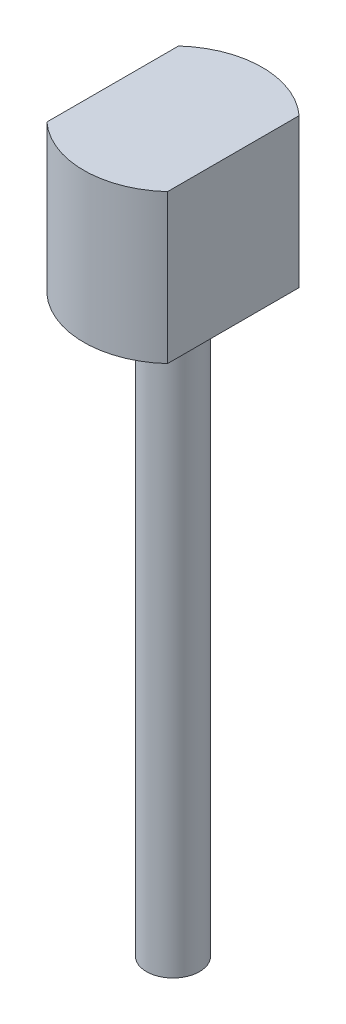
ISO-10303-21;
HEADER;
FILE_DESCRIPTION(('STEP AP214'),'2;1');
FILE_NAME('part.step','',(''),(''),'','','');
FILE_SCHEMA(('AUTOMOTIVE_DESIGN { 1 0 10303 214 1 1 1 1 }'));
ENDSEC;
DATA;
#1=APPLICATION_CONTEXT('core data for automotive mechanical design processes');
#2=APPLICATION_PROTOCOL_DEFINITION('international standard','automotive_design',2000,#1);
#3=PRODUCT_CONTEXT('',#1,'mechanical');
#4=PRODUCT('Part','Part','',(#3));
#5=PRODUCT_RELATED_PRODUCT_CATEGORY('part','',(#4));
#6=PRODUCT_DEFINITION_FORMATION('','',#4);
#7=PRODUCT_DEFINITION_CONTEXT('part definition',#1,'design');
#8=PRODUCT_DEFINITION('design','',#6,#7);
#9=PRODUCT_DEFINITION_SHAPE('','',#8);
#10=(LENGTH_UNIT() NAMED_UNIT(*) SI_UNIT(.MILLI.,.METRE.));
#11=(NAMED_UNIT(*) PLANE_ANGLE_UNIT() SI_UNIT($,.RADIAN.));
#12=(NAMED_UNIT(*) SI_UNIT($,.STERADIAN.) SOLID_ANGLE_UNIT());
#13=UNCERTAINTY_MEASURE_WITH_UNIT(LENGTH_MEASURE(1.E-05),#10,'distance_accuracy_value','');
#14=(GEOMETRIC_REPRESENTATION_CONTEXT(3) GLOBAL_UNCERTAINTY_ASSIGNED_CONTEXT((#13)) GLOBAL_UNIT_ASSIGNED_CONTEXT((#10,
#11,#12)) REPRESENTATION_CONTEXT('',''));
#15=CARTESIAN_POINT('',(0.,0.,0.));
#16=DIRECTION('',(0.,0.,1.));
#17=DIRECTION('',(1.,0.,0.));
#18=AXIS2_PLACEMENT_3D('',#15,#16,#17);
#19=CARTESIAN_POINT('',(0.,0.,0.));
#20=DIRECTION('',(0.,1.,0.));
#21=DIRECTION('',(0.,0.,1.));
#22=AXIS2_PLACEMENT_3D('',#19,#20,#21);
#23=PLANE('',#22);
#24=CARTESIAN_POINT('',(0.,0.,0.));
#25=DIRECTION('',(0.,1.,0.));
#26=DIRECTION('',(0.,0.,1.));
#27=AXIS2_PLACEMENT_3D('',#24,#25,#26);
#28=CIRCLE('',#27,3.5);
#29=CARTESIAN_POINT('',(-2.365,0.,2.58007267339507));
#30=VERTEX_POINT('',#29);
#31=CARTESIAN_POINT('',(2.365,0.,2.58007267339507));
#32=VERTEX_POINT('',#31);
#33=EDGE_CURVE('E100',#30,#32,#28,.T.);
#34=ORIENTED_EDGE('',*,*,#33,.F.);
#35=DIRECTION('',(0.,0.,1.));
#36=VECTOR('',#35,1.);
#37=CARTESIAN_POINT('',(-2.365,0.,2.58007267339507));
#38=LINE('',#37,#36);
#39=CARTESIAN_POINT('',(-2.365,0.,-2.58007267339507));
#40=VERTEX_POINT('',#39);
#41=EDGE_CURVE('E73',#40,#30,#38,.T.);
#42=ORIENTED_EDGE('',*,*,#41,.F.);
#43=CARTESIAN_POINT('',(0.,0.,0.));
#44=DIRECTION('',(0.,1.,0.));
#45=DIRECTION('',(0.,0.,1.));
#46=AXIS2_PLACEMENT_3D('',#43,#44,#45);
#47=CIRCLE('',#46,3.5);
#48=CARTESIAN_POINT('',(2.365,0.,-2.58007267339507));
#49=VERTEX_POINT('',#48);
#50=EDGE_CURVE('E67',#49,#40,#47,.T.);
#51=ORIENTED_EDGE('',*,*,#50,.F.);
#52=DIRECTION('',(0.,0.,-1.));
#53=VECTOR('',#52,1.);
#54=CARTESIAN_POINT('',(2.365,0.,2.58007267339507));
#55=LINE('',#54,#53);
#56=EDGE_CURVE('E91',#32,#49,#55,.T.);
#57=ORIENTED_EDGE('',*,*,#56,.F.);
#58=EDGE_LOOP('',(#34,#42,#51,#57));
#59=FACE_BOUND('',#58,.T.);
#60=CARTESIAN_POINT('',(0.,0.,0.));
#61=DIRECTION('',(0.,1.,0.));
#62=DIRECTION('',(0.,0.,1.));
#63=AXIS2_PLACEMENT_3D('',#60,#61,#62);
#64=CIRCLE('',#63,1.0414);
#65=CARTESIAN_POINT('',(0.,0.,1.0414));
#66=VERTEX_POINT('',#65);
#67=EDGE_CURVE('E11',#66,#66,#64,.F.);
#68=ORIENTED_EDGE('',*,*,#67,.F.);
#69=EDGE_LOOP('',(#68));
#70=FACE_BOUND('',#69,.T.);
#71=ADVANCED_FACE('F33',(#59,#70),#23,.F.);
#72=CARTESIAN_POINT('',(0.,5.84,0.));
#73=DIRECTION('',(0.,-1.,0.));
#74=DIRECTION('',(0.,0.,-1.));
#75=AXIS2_PLACEMENT_3D('',#72,#73,#74);
#76=CYLINDRICAL_SURFACE('',#75,3.5);
#77=ORIENTED_EDGE('',*,*,#33,.T.);
#78=DIRECTION('',(0.,-1.,0.));
#79=VECTOR('',#78,1.);
#80=CARTESIAN_POINT('',(2.365,5.84,2.58007267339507));
#81=LINE('',#80,#79);
#82=CARTESIAN_POINT('',(2.365,5.84,2.58007267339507));
#83=VERTEX_POINT('',#82);
#84=EDGE_CURVE('E42',#83,#32,#81,.T.);
#85=ORIENTED_EDGE('',*,*,#84,.F.);
#86=CARTESIAN_POINT('',(0.,5.84,0.));
#87=DIRECTION('',(0.,1.,0.));
#88=DIRECTION('',(0.,0.,1.));
#89=AXIS2_PLACEMENT_3D('',#86,#87,#88);
#90=CIRCLE('',#89,3.5);
#91=CARTESIAN_POINT('',(-2.365,5.84,2.58007267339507));
#92=VERTEX_POINT('',#91);
#93=EDGE_CURVE('E86',#92,#83,#90,.T.);
#94=ORIENTED_EDGE('',*,*,#93,.F.);
#95=DIRECTION('',(0.,-1.,0.));
#96=VECTOR('',#95,1.);
#97=CARTESIAN_POINT('',(-2.365,5.84,2.58007267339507));
#98=LINE('',#97,#96);
#99=EDGE_CURVE('E96',#92,#30,#98,.T.);
#100=ORIENTED_EDGE('',*,*,#99,.T.);
#101=EDGE_LOOP('',(#77,#85,#94,#100));
#102=FACE_BOUND('',#101,.T.);
#103=ADVANCED_FACE('F35',(#102),#76,.T.);
#104=CARTESIAN_POINT('',(2.365,5.84,2.58007267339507));
#105=DIRECTION('',(-1.,0.,0.));
#106=DIRECTION('',(0.,0.,1.));
#107=AXIS2_PLACEMENT_3D('',#104,#105,#106);
#108=PLANE('',#107);
#109=ORIENTED_EDGE('',*,*,#56,.T.);
#110=DIRECTION('',(0.,-1.,0.));
#111=VECTOR('',#110,1.);
#112=CARTESIAN_POINT('',(2.365,5.84,-2.58007267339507));
#113=LINE('',#112,#111);
#114=CARTESIAN_POINT('',(2.365,5.84,-2.58007267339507));
#115=VERTEX_POINT('',#114);
#116=EDGE_CURVE('E89',#115,#49,#113,.T.);
#117=ORIENTED_EDGE('',*,*,#116,.F.);
#118=DIRECTION('',(0.,0.,-1.));
#119=VECTOR('',#118,1.);
#120=CARTESIAN_POINT('',(2.365,5.84,2.58007267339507));
#121=LINE('',#120,#119);
#122=EDGE_CURVE('E81',#83,#115,#121,.T.);
#123=ORIENTED_EDGE('',*,*,#122,.F.);
#124=ORIENTED_EDGE('',*,*,#84,.T.);
#125=EDGE_LOOP('',(#109,#117,#123,#124));
#126=FACE_BOUND('',#125,.T.);
#127=ADVANCED_FACE('F90',(#126),#108,.F.);
#128=CARTESIAN_POINT('',(0.,5.84,0.));
#129=DIRECTION('',(0.,-1.,0.));
#130=DIRECTION('',(0.,0.,-1.));
#131=AXIS2_PLACEMENT_3D('',#128,#129,#130);
#132=CYLINDRICAL_SURFACE('',#131,3.5);
#133=ORIENTED_EDGE('',*,*,#50,.T.);
#134=DIRECTION('',(0.,-1.,0.));
#135=VECTOR('',#134,1.);
#136=CARTESIAN_POINT('',(-2.365,5.84,-2.58007267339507));
#137=LINE('',#136,#135);
#138=CARTESIAN_POINT('',(-2.365,5.84,-2.58007267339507));
#139=VERTEX_POINT('',#138);
#140=EDGE_CURVE('E92',#139,#40,#137,.T.);
#141=ORIENTED_EDGE('',*,*,#140,.F.);
#142=CARTESIAN_POINT('',(0.,5.84,0.));
#143=DIRECTION('',(0.,1.,0.));
#144=DIRECTION('',(0.,0.,1.));
#145=AXIS2_PLACEMENT_3D('',#142,#143,#144);
#146=CIRCLE('',#145,3.5);
#147=EDGE_CURVE('E84',#115,#139,#146,.T.);
#148=ORIENTED_EDGE('',*,*,#147,.F.);
#149=ORIENTED_EDGE('',*,*,#116,.T.);
#150=EDGE_LOOP('',(#133,#141,#148,#149));
#151=FACE_BOUND('',#150,.T.);
#152=ADVANCED_FACE('F94',(#151),#132,.T.);
#153=CARTESIAN_POINT('',(-2.365,5.84,2.58007267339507));
#154=DIRECTION('',(1.,0.,0.));
#155=DIRECTION('',(0.,0.,-1.));
#156=AXIS2_PLACEMENT_3D('',#153,#154,#155);
#157=PLANE('',#156);
#158=ORIENTED_EDGE('',*,*,#41,.T.);
#159=ORIENTED_EDGE('',*,*,#99,.F.);
#160=DIRECTION('',(0.,0.,1.));
#161=VECTOR('',#160,1.);
#162=CARTESIAN_POINT('',(-2.365,5.84,2.58007267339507));
#163=LINE('',#162,#161);
#164=EDGE_CURVE('E50',#139,#92,#163,.T.);
#165=ORIENTED_EDGE('',*,*,#164,.F.);
#166=ORIENTED_EDGE('',*,*,#140,.T.);
#167=EDGE_LOOP('',(#158,#159,#165,#166));
#168=FACE_BOUND('',#167,.T.);
#169=ADVANCED_FACE('F127',(#168),#157,.F.);
#170=CARTESIAN_POINT('',(0.,5.84,0.));
#171=DIRECTION('',(0.,1.,0.));
#172=DIRECTION('',(0.,0.,1.));
#173=AXIS2_PLACEMENT_3D('',#170,#171,#172);
#174=PLANE('',#173);
#175=ORIENTED_EDGE('',*,*,#93,.T.);
#176=ORIENTED_EDGE('',*,*,#122,.T.);
#177=ORIENTED_EDGE('',*,*,#147,.T.);
#178=ORIENTED_EDGE('',*,*,#164,.T.);
#179=EDGE_LOOP('',(#175,#176,#177,#178));
#180=FACE_BOUND('',#179,.T.);
#181=ADVANCED_FACE('F82',(#180),#174,.T.);
#182=CARTESIAN_POINT('',(0.,-22.6,0.));
#183=DIRECTION('',(0.,1.,0.));
#184=DIRECTION('',(0.,0.,1.));
#185=AXIS2_PLACEMENT_3D('',#182,#183,#184);
#186=CYLINDRICAL_SURFACE('',#185,1.0414);
#187=CARTESIAN_POINT('',(0.,-22.6,0.));
#188=DIRECTION('',(0.,-1.,0.));
#189=DIRECTION('',(0.,0.,-1.));
#190=AXIS2_PLACEMENT_3D('',#187,#188,#189);
#191=CIRCLE('',#190,1.0414);
#192=CARTESIAN_POINT('',(0.,-22.6,-1.0414));
#193=VERTEX_POINT('',#192);
#194=EDGE_CURVE('E103',#193,#193,#191,.T.);
#195=ORIENTED_EDGE('',*,*,#194,.F.);
#196=EDGE_LOOP('',(#195));
#197=FACE_BOUND('',#196,.T.);
#198=ORIENTED_EDGE('',*,*,#67,.T.);
#199=EDGE_LOOP('',(#198));
#200=FACE_BOUND('',#199,.T.);
#201=ADVANCED_FACE('F116',(#197,#200),#186,.T.);
#202=CARTESIAN_POINT('',(0.,-22.6,0.));
#203=DIRECTION('',(0.,-1.,0.));
#204=DIRECTION('',(0.,0.,-1.));
#205=AXIS2_PLACEMENT_3D('',#202,#203,#204);
#206=PLANE('',#205);
#207=ORIENTED_EDGE('',*,*,#194,.T.);
#208=EDGE_LOOP('',(#207));
#209=FACE_BOUND('',#208,.T.);
#210=ADVANCED_FACE('F118',(#209),#206,.T.);
#211=CLOSED_SHELL('',(#71,#103,#127,#152,#169,#181,#201,#210));
#212=MANIFOLD_SOLID_BREP('B2',#211);
#213=ADVANCED_BREP_SHAPE_REPRESENTATION('',(#18,#212),#14);
#214=SHAPE_DEFINITION_REPRESENTATION(#9,#213);
ENDSEC;
END-ISO-10303-21;
